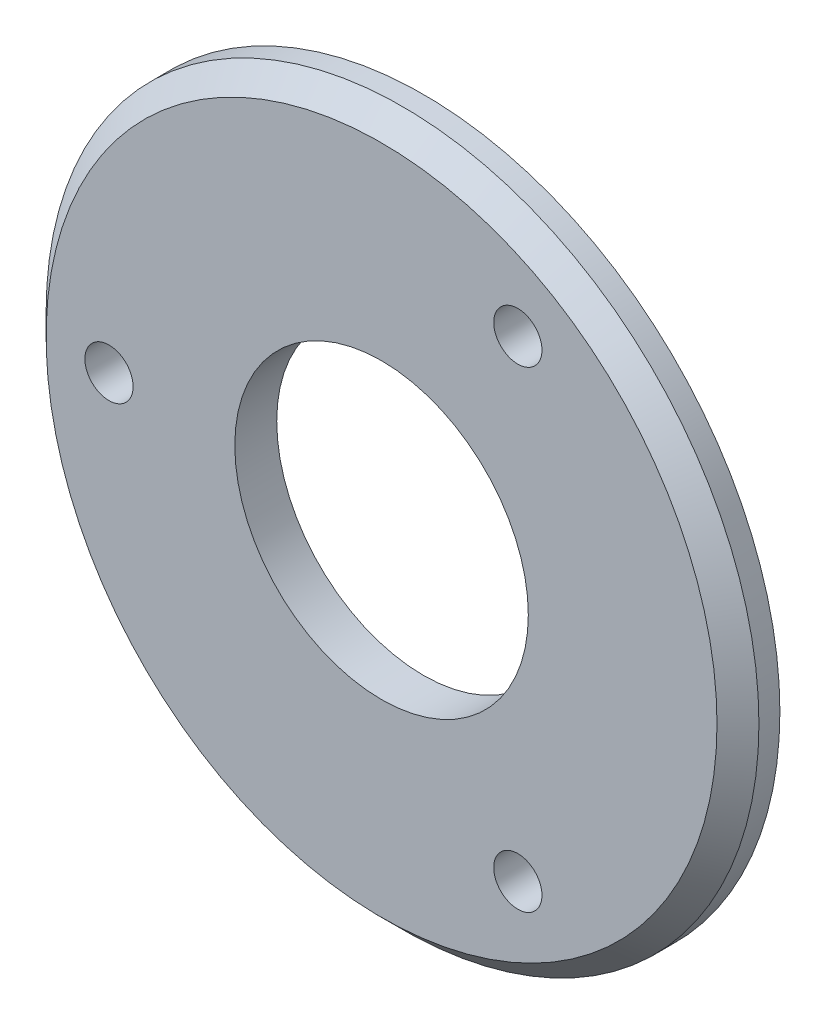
from build123d import *

# Parameters (mm, degrees)
ESQUISSE1_R                  = 85
ESQUISSE1_R_2                = 35
BOSS_EXTRU_1_DEPTH           = 10
ESQUISSE2_R                  = 5.75
ENL_V_MAT_EXTRU_2_DEPTH      = 10
R_P_TITION_CIRCULAIRE1_COUNT = 3
CHANFREIN1_SIZE              = 5


with BuildPart() as part:
    # Esquisse1 → Boss.-Extru.1 (new body)
    with BuildSketch(Plane.XY):
        Circle(ESQUISSE1_R)
        Circle(ESQUISSE1_R_2, mode=Mode.SUBTRACT)
    extrude(amount=BOSS_EXTRU_1_DEPTH)

    # Esquisse2 → Enl_v. mat.-Extru.2 (cut)
    with BuildSketch(Plane.XY.offset(10)):
        with Locations((32.5, 56.291651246)):
            Circle(ESQUISSE2_R)
    enl_v_mat_extru_2 = extrude(amount=-ENL_V_MAT_EXTRU_2_DEPTH, mode=Mode.SUBTRACT)

    # R_p_tition circulaire1: Enl_v. mat.-Extru.2 ×3 about axis
    r_p_tition_circulaire1_axis = Axis((0, 0, 0), (0, 0, 1))
    for i in range(1, R_P_TITION_CIRCULAIRE1_COUNT):
        add(enl_v_mat_extru_2.rotate(r_p_tition_circulaire1_axis, i * 360 / R_P_TITION_CIRCULAIRE1_COUNT), mode=Mode.SUBTRACT)

    # Chanfrein1
    chanfrein1_edges = [part.edges().sort_by_distance(p)[0] for p in [
        (-85, 0, 10),
    ]]
    chamfer(chanfrein1_edges, length=CHANFREIN1_SIZE)


solid = part.part
